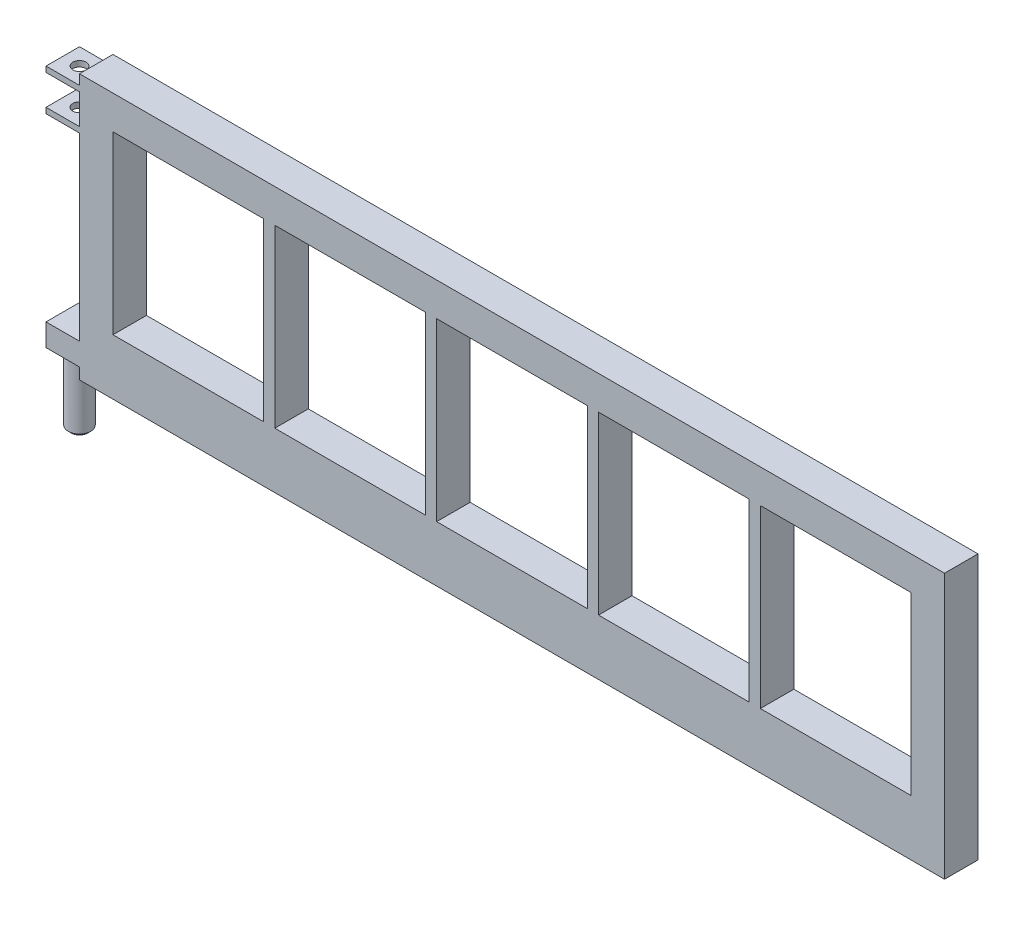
from build123d import *

# Parameters (mm, degrees)
ESQUISSE1_W                = 775
ESQUISSE1_H                = 237.5
ESQUISSE1_W_2              = 715
ESQUISSE1_H_2              = 157.5
BASE_EXTRUSION_DEPTH       = 30
ESQUISSE2_W                = 30
ESQUISSE2_H                = 5
BOSS_EXTRU_1_DEPTH         = 30
ESQUISSE3_R                = 6
ENL_V_MAT_EXTRU_1_DEPTH    = 714.258193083
BOSS_EXTRU_2_REACH         = 703.2
ESQUISSE4_W                = 10
ESQUISSE4_H                = 30
R_P_TITION_LIN_AIRE1_COUNT = 4
R_P_TITION_LIN_AIRE1_PITCH = 145
ESQUISSE5_W                = 30
ESQUISSE5_H                = 20
BOSS_EXTRU_3_DEPTH         = 30
ESQUISSE6_R                = 10
BOSS_EXTRU_4_DEPTH         = 62.5
CHANFREIN1_SIZE            = 2.5
ESQUISSE7_W                = 28.902036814
ESQUISSE7_H                = 217.666323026
EXTRUSION1_DEPTH           = 0.01


with BuildPart() as part:
    # Esquisse1 → Base-Extrusion (new body)
    with BuildSketch(Plane.XY):
        with Locations((287.5, 48.75)):
            Rectangle(ESQUISSE1_W, ESQUISSE1_H)
        with Locations((287.5, 58.75)):
            Rectangle(ESQUISSE1_W_2, ESQUISSE1_H_2, mode=Mode.SUBTRACT)
    extrude(amount=BASE_EXTRUSION_DEPTH)

    # Esquisse2 → Boss.-Extru.1 (add)
    with BuildSketch(Plane.ZY.offset(100)):
        with Locations((15, 156)):
            Rectangle(ESQUISSE2_W, ESQUISSE2_H)
        with Locations((15, 124)):
            Rectangle(ESQUISSE2_W, ESQUISSE2_H)
    extrude(amount=BOSS_EXTRU_1_DEPTH)

    # Esquisse3 → Enl_v. mat.-Extru.1 (cut, through all)
    with BuildSketch(Plane(origin=(0, 158.5, 0), x_dir=(-1, 0, 0), z_dir=(0, 1, 0))):
        with Locations((115, 15)):
            Circle(ESQUISSE3_R)
    extrude(amount=-ENL_V_MAT_EXTRU_1_DEPTH, mode=Mode.SUBTRACT)

    # Esquisse4 → Boss.-Extru.2 (add, up to next)
    with BuildSketch(Plane(origin=(0, -20, 0), x_dir=(-1, 0, 0), z_dir=(0, 1, 0)), mode=Mode.PRIVATE) as boss_extru_2_sk1:
        with Locations((-505, 15)):
            Rectangle(ESQUISSE4_W, ESQUISSE4_H)
    boss_extru_2_tool1 = extrude(boss_extru_2_sk1.sketch, amount=BOSS_EXTRU_2_REACH, mode=Mode.PRIVATE) - part.part
    boss_extru_2 = boss_extru_2_tool1.solids().sort_by_distance((505, -20, 15))[0]
    add(boss_extru_2)

    # R_p_tition lin_aire1: Boss.-Extru.2 ×4
    with Locations(*[(-i * R_P_TITION_LIN_AIRE1_PITCH, 0, 0) for i in range(1, R_P_TITION_LIN_AIRE1_COUNT)]):
        add(boss_extru_2)

    # Esquisse5 → Boss.-Extru.3 (add)
    with BuildSketch(Plane.ZY.offset(100)):
        with Locations((15, -50)):
            Rectangle(ESQUISSE5_W, ESQUISSE5_H)
    extrude(amount=BOSS_EXTRU_3_DEPTH)

    # Esquisse6 → Boss.-Extru.4 (add)
    with BuildSketch(Plane.XZ.offset(60)):
        with Locations(Location((-115, 15, 0), (0, 0, 180))):
            Circle(ESQUISSE6_R)
    extrude(amount=BOSS_EXTRU_4_DEPTH)

    # Chanfrein1
    chanfrein1_edges = [part.edges().sort_by_distance(p)[0] for p in [
        (-105, -122.5, 15),
    ]]
    chamfer(chanfrein1_edges, length=CHANFREIN1_SIZE)

    # Esquisse7 → Extrusion1 (add)
    with BuildSketch(Plane(origin=(0, 0, 0), x_dir=(-1, 0, 0), z_dir=(0, 0, -1))):
        with Locations((-660.548981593, 58.666838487)):
            Rectangle(ESQUISSE7_W, ESQUISSE7_H)
    extrude(amount=EXTRUSION1_DEPTH)


solid = part.part
